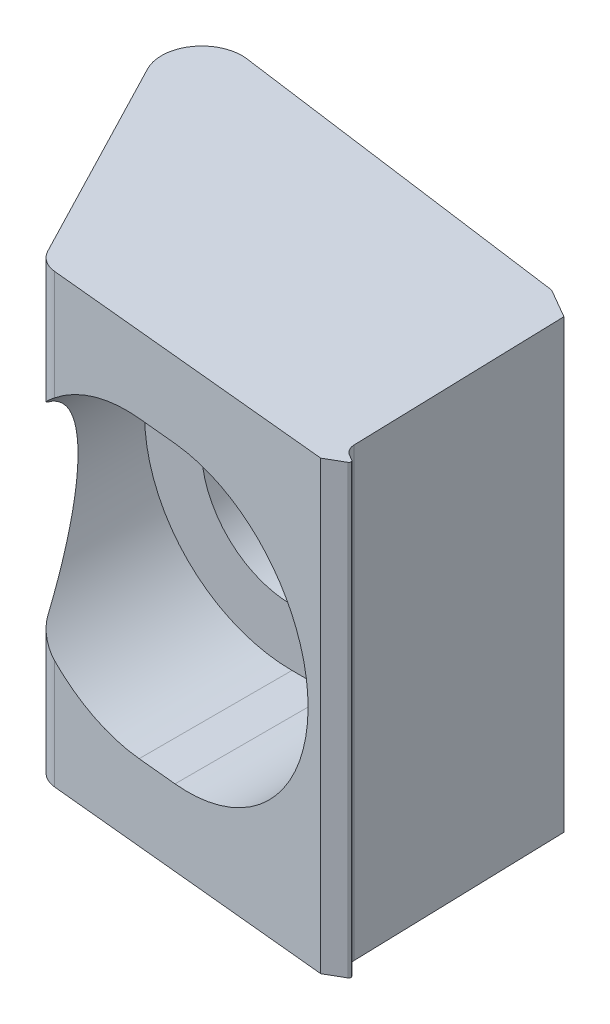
ISO-10303-21;
HEADER;
FILE_DESCRIPTION(('STEP AP214'),'2;1');
FILE_NAME('part.step','',(''),(''),'','','');
FILE_SCHEMA(('AUTOMOTIVE_DESIGN { 1 0 10303 214 1 1 1 1 }'));
ENDSEC;
DATA;
#1=APPLICATION_CONTEXT('core data for automotive mechanical design processes');
#2=APPLICATION_PROTOCOL_DEFINITION('international standard','automotive_design',2000,#1);
#3=PRODUCT_CONTEXT('',#1,'mechanical');
#4=PRODUCT('Part','Part','',(#3));
#5=PRODUCT_RELATED_PRODUCT_CATEGORY('part','',(#4));
#6=PRODUCT_DEFINITION_FORMATION('','',#4);
#7=PRODUCT_DEFINITION_CONTEXT('part definition',#1,'design');
#8=PRODUCT_DEFINITION('design','',#6,#7);
#9=PRODUCT_DEFINITION_SHAPE('','',#8);
#10=(LENGTH_UNIT() NAMED_UNIT(*) SI_UNIT(.MILLI.,.METRE.));
#11=(NAMED_UNIT(*) PLANE_ANGLE_UNIT() SI_UNIT($,.RADIAN.));
#12=(NAMED_UNIT(*) SI_UNIT($,.STERADIAN.) SOLID_ANGLE_UNIT());
#13=UNCERTAINTY_MEASURE_WITH_UNIT(LENGTH_MEASURE(1.E-05),#10,'distance_accuracy_value','');
#14=(GEOMETRIC_REPRESENTATION_CONTEXT(3) GLOBAL_UNCERTAINTY_ASSIGNED_CONTEXT((#13)) GLOBAL_UNIT_ASSIGNED_CONTEXT((#10,
#11,#12)) REPRESENTATION_CONTEXT('',''));
#15=CARTESIAN_POINT('',(0.,0.,0.));
#16=DIRECTION('',(0.,0.,1.));
#17=DIRECTION('',(1.,0.,0.));
#18=AXIS2_PLACEMENT_3D('',#15,#16,#17);
#19=CARTESIAN_POINT('',(-7.43454612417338,12.7,14.44498));
#20=DIRECTION('',(0.,-1.,0.));
#21=DIRECTION('',(1.,0.,0.));
#22=AXIS2_PLACEMENT_3D('',#19,#20,#21);
#23=CYLINDRICAL_SURFACE('',#22,1.524);
#24=DIRECTION('',(0.,-1.,0.));
#25=VECTOR('',#24,1.);
#26=CARTESIAN_POINT('',(-8.78703398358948,12.7,15.1473706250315));
#27=LINE('',#26,#25);
#28=CARTESIAN_POINT('',(-8.78703398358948,12.7,15.1473706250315));
#29=VERTEX_POINT('',#28);
#30=CARTESIAN_POINT('',(-8.78703398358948,5.25961818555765,15.1473706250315));
#31=VERTEX_POINT('',#30);
#32=EDGE_CURVE('E307',#29,#31,#27,.T.);
#33=ORIENTED_EDGE('',*,*,#32,.T.);
#34=CARTESIAN_POINT('',(-8.78703398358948,5.25961818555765,15.1473706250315));
#35=CARTESIAN_POINT('',(-8.76079085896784,5.29219779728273,15.197829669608));
#36=CARTESIAN_POINT('',(-8.73240940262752,5.32690217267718,15.2456475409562));
#37=CARTESIAN_POINT('',(-8.67202665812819,5.39941708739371,15.3361563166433));
#38=CARTESIAN_POINT('',(-8.64003507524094,5.43721922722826,15.378860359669));
#39=CARTESIAN_POINT('',(-8.57303319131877,5.51486622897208,15.4594529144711));
#40=CARTESIAN_POINT('',(-8.53803105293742,5.55470545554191,15.4973537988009));
#41=CARTESIAN_POINT('',(-8.46526377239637,5.63587115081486,15.568722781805));
#42=CARTESIAN_POINT('',(-8.42749637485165,5.67719881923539,15.602187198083));
#43=CARTESIAN_POINT('',(-8.34401173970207,5.76665149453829,15.6691939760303));
#44=CARTESIAN_POINT('',(-8.29792270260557,5.81491640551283,15.7020880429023));
#45=CARTESIAN_POINT('',(-8.20284394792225,5.91204734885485,15.7623510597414));
#46=CARTESIAN_POINT('',(-8.15385233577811,5.9609137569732,15.7897163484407));
#47=CARTESIAN_POINT('',(-8.00293341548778,6.10762483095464,15.8634430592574));
#48=CARTESIAN_POINT('',(-7.89693807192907,6.20571552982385,15.9015337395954));
#49=CARTESIAN_POINT('',(-7.75345208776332,6.33154954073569,15.9356379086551));
#50=CARTESIAN_POINT('',(-7.71955399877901,6.36079990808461,15.9424956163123));
#51=CARTESIAN_POINT('',(-7.65115725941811,6.41886368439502,15.953904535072));
#52=CARTESIAN_POINT('',(-7.61666038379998,6.44767802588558,15.958461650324));
#53=CARTESIAN_POINT('',(-7.58184451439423,6.47628603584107,15.9618449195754));
#54=B_SPLINE_CURVE_WITH_KNOTS('',3,(#34,#35,#36,#37,#38,#39,#40,#41,#42,#43,#44,#45,#46,#47,#48,
#49,#50,#51,#52,#53),.UNSPECIFIED.,.F.,.F.,(4,2,2,2,2,2,2,2,2,4),(0.,0.196340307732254,
0.392164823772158,0.587474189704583,0.782944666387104,1.00585043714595,1.22890334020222,
1.67439355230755,1.8102402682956,1.94573655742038),.UNSPECIFIED.);
#55=CARTESIAN_POINT('',(-7.58184451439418,6.47628603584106,15.9618449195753));
#56=VERTEX_POINT('',#55);
#57=EDGE_CURVE('E210',#31,#56,#54,.T.);
#58=ORIENTED_EDGE('',*,*,#57,.T.);
#59=DIRECTION('',(0.,-1.,0.));
#60=VECTOR('',#59,1.);
#61=CARTESIAN_POINT('',(-7.58184451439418,12.7,15.9618449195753));
#62=LINE('',#61,#60);
#63=CARTESIAN_POINT('',(-7.58184451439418,12.7,15.9618449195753));
#64=VERTEX_POINT('',#63);
#65=EDGE_CURVE('E303',#64,#56,#62,.T.);
#66=ORIENTED_EDGE('',*,*,#65,.F.);
#67=CARTESIAN_POINT('',(-7.43454612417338,12.7,14.44498));
#68=DIRECTION('',(0.,1.,0.));
#69=DIRECTION('',(-1.,0.,0.));
#70=AXIS2_PLACEMENT_3D('',#67,#68,#69);
#71=CIRCLE('',#70,1.524);
#72=EDGE_CURVE('E295',#29,#64,#71,.T.);
#73=ORIENTED_EDGE('',*,*,#72,.F.);
#74=EDGE_LOOP('',(#33,#58,#66,#73));
#75=FACE_BOUND('',#74,.T.);
#76=ADVANCED_FACE('F14',(#75),#23,.T.);
#77=CARTESIAN_POINT('',(9.17959387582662,12.7,17.5895));
#78=DIRECTION('',(-0.499733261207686,0.,-0.866179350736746));
#79=DIRECTION('',(-0.866179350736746,0.,0.499733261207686));
#80=AXIS2_PLACEMENT_3D('',#77,#78,#79);
#81=PLANE('',#80);
#82=DIRECTION('',(0.866179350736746,0.,-0.499733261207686));
#83=VECTOR('',#82,1.);
#84=CARTESIAN_POINT('',(9.17959387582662,-12.7,17.5895));
#85=LINE('',#84,#83);
#86=CARTESIAN_POINT('',(9.17959387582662,-12.7,17.5895));
#87=VERTEX_POINT('',#86);
#88=CARTESIAN_POINT('',(10.16,-12.7,17.0238647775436));
#89=VERTEX_POINT('',#88);
#90=EDGE_CURVE('E251',#87,#89,#85,.T.);
#91=ORIENTED_EDGE('',*,*,#90,.T.);
#92=DIRECTION('',(0.,-1.,0.));
#93=VECTOR('',#92,1.);
#94=CARTESIAN_POINT('',(10.16,12.7,17.0238647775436));
#95=LINE('',#94,#93);
#96=CARTESIAN_POINT('',(10.16,12.7,17.0238647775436));
#97=VERTEX_POINT('',#96);
#98=EDGE_CURVE('E331',#97,#89,#95,.T.);
#99=ORIENTED_EDGE('',*,*,#98,.F.);
#100=DIRECTION('',(0.866179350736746,0.,-0.499733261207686));
#101=VECTOR('',#100,1.);
#102=CARTESIAN_POINT('',(9.17959387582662,12.7,17.5895));
#103=LINE('',#102,#101);
#104=CARTESIAN_POINT('',(9.17959387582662,12.7,17.5895));
#105=VERTEX_POINT('',#104);
#106=EDGE_CURVE('E276',#105,#97,#103,.T.);
#107=ORIENTED_EDGE('',*,*,#106,.F.);
#108=DIRECTION('',(0.,-1.,0.));
#109=VECTOR('',#108,1.);
#110=CARTESIAN_POINT('',(9.17959387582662,12.7,17.5895));
#111=LINE('',#110,#109);
#112=EDGE_CURVE('E299',#105,#87,#111,.T.);
#113=ORIENTED_EDGE('',*,*,#112,.T.);
#114=EDGE_LOOP('',(#91,#99,#107,#113));
#115=FACE_BOUND('',#114,.T.);
#116=ADVANCED_FACE('F16',(#115),#81,.F.);
#117=CARTESIAN_POINT('',(10.0965338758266,12.7,16.91386));
#118=DIRECTION('',(0.,-1.,0.));
#119=DIRECTION('',(1.,0.,0.));
#120=AXIS2_PLACEMENT_3D('',#117,#118,#119);
#121=CYLINDRICAL_SURFACE('',#120,0.127);
#122=CARTESIAN_POINT('',(10.0965338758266,-12.7,16.91386));
#123=DIRECTION('',(0.,1.,0.));
#124=DIRECTION('',(-1.,0.,0.));
#125=AXIS2_PLACEMENT_3D('',#122,#123,#124);
#126=CIRCLE('',#125,0.127);
#127=CARTESIAN_POINT('',(10.160562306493,-12.7,16.8041815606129));
#128=VERTEX_POINT('',#127);
#129=EDGE_CURVE('E254',#89,#128,#126,.T.);
#130=ORIENTED_EDGE('',*,*,#129,.T.);
#131=DIRECTION('',(0.,-1.,0.));
#132=VECTOR('',#131,1.);
#133=CARTESIAN_POINT('',(10.160562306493,12.7,16.8041815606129));
#134=LINE('',#133,#132);
#135=CARTESIAN_POINT('',(10.160562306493,12.7,16.8041815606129));
#136=VERTEX_POINT('',#135);
#137=EDGE_CURVE('E328',#136,#128,#134,.T.);
#138=ORIENTED_EDGE('',*,*,#137,.F.);
#139=CARTESIAN_POINT('',(10.0965338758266,12.7,16.91386));
#140=DIRECTION('',(0.,1.,0.));
#141=DIRECTION('',(-1.,0.,0.));
#142=AXIS2_PLACEMENT_3D('',#139,#140,#141);
#143=CIRCLE('',#142,0.127);
#144=EDGE_CURVE('E279',#97,#136,#143,.T.);
#145=ORIENTED_EDGE('',*,*,#144,.F.);
#146=ORIENTED_EDGE('',*,*,#98,.T.);
#147=EDGE_LOOP('',(#130,#138,#145,#146));
#148=FACE_BOUND('',#147,.T.);
#149=ADVANCED_FACE('F381',(#148),#121,.T.);
#150=CARTESIAN_POINT('',(10.160562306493,12.7,16.8041815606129));
#151=DIRECTION('',(-0.504160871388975,0.,0.86360975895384));
#152=DIRECTION('',(0.86360975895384,0.,0.504160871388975));
#153=AXIS2_PLACEMENT_3D('',#150,#151,#152);
#154=PLANE('',#153);
#155=DIRECTION('',(-0.86360975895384,0.,-0.504160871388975));
#156=VECTOR('',#155,1.);
#157=CARTESIAN_POINT('',(10.160562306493,-12.7,16.8041815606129));
#158=LINE('',#157,#156);
#159=CARTESIAN_POINT('',(9.85714329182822,-12.7,16.6270506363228));
#160=VERTEX_POINT('',#159);
#161=EDGE_CURVE('E256',#128,#160,#158,.T.);
#162=ORIENTED_EDGE('',*,*,#161,.T.);
#163=DIRECTION('',(0.,-1.,0.));
#164=VECTOR('',#163,1.);
#165=CARTESIAN_POINT('',(9.85714329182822,12.7,16.6270506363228));
#166=LINE('',#165,#164);
#167=CARTESIAN_POINT('',(9.85714329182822,12.7,16.6270506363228));
#168=VERTEX_POINT('',#167);
#169=EDGE_CURVE('E325',#168,#160,#166,.T.);
#170=ORIENTED_EDGE('',*,*,#169,.F.);
#171=DIRECTION('',(-0.86360975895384,0.,-0.504160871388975));
#172=VECTOR('',#171,1.);
#173=CARTESIAN_POINT('',(10.160562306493,12.7,16.8041815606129));
#174=LINE('',#173,#172);
#175=EDGE_CURVE('E281',#136,#168,#174,.T.);
#176=ORIENTED_EDGE('',*,*,#175,.F.);
#177=ORIENTED_EDGE('',*,*,#137,.T.);
#178=EDGE_LOOP('',(#162,#170,#176,#177));
#179=FACE_BOUND('',#178,.T.);
#180=ADVANCED_FACE('F413',(#179),#154,.F.);
#181=CARTESIAN_POINT('',(10.2413138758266,12.7,15.96898));
#182=DIRECTION('',(0.,-1.,0.));
#183=DIRECTION('',(1.,0.,0.));
#184=AXIS2_PLACEMENT_3D('',#181,#182,#183);
#185=CYLINDRICAL_SURFACE('',#184,0.762);
#186=CARTESIAN_POINT('',(10.2413138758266,-12.7,15.96898));
#187=DIRECTION('',(0.,-1.,0.));
#188=DIRECTION('',(-1.,0.,0.));
#189=AXIS2_PLACEMENT_3D('',#186,#187,#188);
#190=CIRCLE('',#189,0.762);
#191=CARTESIAN_POINT('',(9.47962441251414,-12.7,15.9907322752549));
#192=VERTEX_POINT('',#191);
#193=EDGE_CURVE('E258',#160,#192,#190,.T.);
#194=ORIENTED_EDGE('',*,*,#193,.T.);
#195=DIRECTION('',(0.,-1.,0.));
#196=VECTOR('',#195,1.);
#197=CARTESIAN_POINT('',(9.47962441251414,12.7,15.9907322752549));
#198=LINE('',#197,#196);
#199=CARTESIAN_POINT('',(9.47962441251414,12.7,15.9907322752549));
#200=VERTEX_POINT('',#199);
#201=EDGE_CURVE('E322',#200,#192,#198,.T.);
#202=ORIENTED_EDGE('',*,*,#201,.F.);
#203=CARTESIAN_POINT('',(10.2413138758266,12.7,15.96898));
#204=DIRECTION('',(0.,-1.,0.));
#205=DIRECTION('',(-1.,0.,0.));
#206=AXIS2_PLACEMENT_3D('',#203,#204,#205);
#207=CIRCLE('',#206,0.762);
#208=EDGE_CURVE('E283',#168,#200,#207,.T.);
#209=ORIENTED_EDGE('',*,*,#208,.F.);
#210=ORIENTED_EDGE('',*,*,#169,.T.);
#211=EDGE_LOOP('',(#194,#202,#209,#210));
#212=FACE_BOUND('',#211,.T.);
#213=ADVANCED_FACE('F409',(#212),#185,.F.);
#214=CARTESIAN_POINT('',(9.47962441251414,12.7,15.9907322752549));
#215=DIRECTION('',(-0.99959247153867,0.,0.0285462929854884));
#216=DIRECTION('',(0.0285462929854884,0.,0.99959247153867));
#217=AXIS2_PLACEMENT_3D('',#214,#215,#216);
#218=PLANE('',#217);
#219=DIRECTION('',(-0.0285462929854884,0.,-0.99959247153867));
#220=VECTOR('',#219,1.);
#221=CARTESIAN_POINT('',(9.47962441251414,-12.7,15.9907322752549));
#222=LINE('',#221,#220);
#223=CARTESIAN_POINT('',(9.12879387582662,-12.7,3.70586));
#224=VERTEX_POINT('',#223);
#225=EDGE_CURVE('E260',#192,#224,#222,.T.);
#226=ORIENTED_EDGE('',*,*,#225,.T.);
#227=DIRECTION('',(0.,-1.,0.));
#228=VECTOR('',#227,1.);
#229=CARTESIAN_POINT('',(9.12879387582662,12.7,3.70586));
#230=LINE('',#229,#228);
#231=CARTESIAN_POINT('',(9.12879387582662,12.7,3.70586));
#232=VERTEX_POINT('',#231);
#233=EDGE_CURVE('E319',#232,#224,#230,.T.);
#234=ORIENTED_EDGE('',*,*,#233,.F.);
#235=DIRECTION('',(-0.0285462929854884,0.,-0.99959247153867));
#236=VECTOR('',#235,1.);
#237=CARTESIAN_POINT('',(9.47962441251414,12.7,15.9907322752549));
#238=LINE('',#237,#236);
#239=EDGE_CURVE('E285',#200,#232,#238,.T.);
#240=ORIENTED_EDGE('',*,*,#239,.F.);
#241=ORIENTED_EDGE('',*,*,#201,.T.);
#242=EDGE_LOOP('',(#226,#234,#240,#241));
#243=FACE_BOUND('',#242,.T.);
#244=ADVANCED_FACE('F405',(#243),#218,.F.);
#245=CARTESIAN_POINT('',(9.12879387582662,12.7,3.70586));
#246=DIRECTION('',(-0.500827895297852,0.,0.865546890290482));
#247=DIRECTION('',(0.865546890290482,0.,0.500827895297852));
#248=AXIS2_PLACEMENT_3D('',#245,#246,#247);
#249=PLANE('',#248);
#250=DIRECTION('',(-0.865546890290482,0.,-0.500827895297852));
#251=VECTOR('',#250,1.);
#252=CARTESIAN_POINT('',(9.12879387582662,-12.7,3.70586));
#253=LINE('',#252,#251);
#254=CARTESIAN_POINT('',(7.46509387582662,-12.7,2.7432));
#255=VERTEX_POINT('',#254);
#256=EDGE_CURVE('E262',#224,#255,#253,.T.);
#257=ORIENTED_EDGE('',*,*,#256,.T.);
#258=DIRECTION('',(0.,-1.,0.));
#259=VECTOR('',#258,1.);
#260=CARTESIAN_POINT('',(7.46509387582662,12.7,2.7432));
#261=LINE('',#260,#259);
#262=CARTESIAN_POINT('',(7.46509387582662,12.7,2.7432));
#263=VERTEX_POINT('',#262);
#264=EDGE_CURVE('E316',#263,#255,#261,.T.);
#265=ORIENTED_EDGE('',*,*,#264,.F.);
#266=DIRECTION('',(-0.865546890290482,0.,-0.500827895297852));
#267=VECTOR('',#266,1.);
#268=CARTESIAN_POINT('',(9.12879387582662,12.7,3.70586));
#269=LINE('',#268,#267);
#270=EDGE_CURVE('E287',#232,#263,#269,.T.);
#271=ORIENTED_EDGE('',*,*,#270,.F.);
#272=ORIENTED_EDGE('',*,*,#233,.T.);
#273=EDGE_LOOP('',(#257,#265,#271,#272));
#274=FACE_BOUND('',#273,.T.);
#275=ADVANCED_FACE('F401',(#274),#249,.F.);
#276=CARTESIAN_POINT('',(-12.5828622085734,12.7,0.0207901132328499));
#277=DIRECTION('',(-0.134559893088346,0.,0.990905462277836));
#278=DIRECTION('',(0.990905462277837,0.,0.134559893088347));
#279=AXIS2_PLACEMENT_3D('',#276,#277,#278);
#280=PLANE('',#279);
#281=DIRECTION('',(-0.990905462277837,0.,-0.134559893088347));
#282=VECTOR('',#281,1.);
#283=CARTESIAN_POINT('',(-12.5828622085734,5.1562,0.0207901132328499));
#284=LINE('',#283,#282);
#285=CARTESIAN_POINT('',(0.,5.1562,1.7294784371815));
#286=VERTEX_POINT('',#285);
#287=CARTESIAN_POINT('',(-2.2606,5.1562,1.42250052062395));
#288=VERTEX_POINT('',#287);
#289=EDGE_CURVE('E188',#286,#288,#284,.T.);
#290=ORIENTED_EDGE('',*,*,#289,.T.);
#291=CARTESIAN_POINT('',(-2.2606,0.,1.42250052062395));
#292=DIRECTION('',(-0.134559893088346,0.,0.990905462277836));
#293=DIRECTION('',(0.990905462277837,0.,0.134559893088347));
#294=AXIS2_PLACEMENT_3D('',#291,#292,#293);
#295=ELLIPSE('',#294,5.2035236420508,5.1562);
#296=CARTESIAN_POINT('',(-2.2606,-5.1562,1.42250052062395));
#297=VERTEX_POINT('',#296);
#298=EDGE_CURVE('E191',#288,#297,#295,.T.);
#299=ORIENTED_EDGE('',*,*,#298,.T.);
#300=DIRECTION('',(0.990905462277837,0.,0.134559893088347));
#301=VECTOR('',#300,1.);
#302=CARTESIAN_POINT('',(-12.5828622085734,-5.1562,0.0207901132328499));
#303=LINE('',#302,#301);
#304=CARTESIAN_POINT('',(0.,-5.1562,1.7294784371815));
#305=VERTEX_POINT('',#304);
#306=EDGE_CURVE('E183',#297,#305,#303,.T.);
#307=ORIENTED_EDGE('',*,*,#306,.T.);
#308=CARTESIAN_POINT('',(0.,0.,1.7294784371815));
#309=DIRECTION('',(-0.134559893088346,0.,0.990905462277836));
#310=DIRECTION('',(0.990905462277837,0.,0.134559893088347));
#311=AXIS2_PLACEMENT_3D('',#308,#309,#310);
#312=ELLIPSE('',#311,5.2035236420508,5.1562);
#313=EDGE_CURVE('E163',#305,#286,#312,.T.);
#314=ORIENTED_EDGE('',*,*,#313,.T.);
#315=EDGE_LOOP('',(#290,#299,#307,#314));
#316=FACE_BOUND('',#315,.T.);
#317=DIRECTION('',(-0.990905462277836,0.,-0.134559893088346));
#318=VECTOR('',#317,1.);
#319=CARTESIAN_POINT('',(-12.5828622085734,-12.7,0.0207901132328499));
#320=LINE('',#319,#318);
#321=CARTESIAN_POINT('',(-12.5828622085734,-12.7,0.0207901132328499));
#322=VERTEX_POINT('',#321);
#323=EDGE_CURVE('E264',#255,#322,#320,.T.);
#324=ORIENTED_EDGE('',*,*,#323,.T.);
#325=DIRECTION('',(0.,-1.,0.));
#326=VECTOR('',#325,1.);
#327=CARTESIAN_POINT('',(-12.5828622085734,12.7,0.0207901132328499));
#328=LINE('',#327,#326);
#329=CARTESIAN_POINT('',(-12.5828622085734,12.7,0.0207901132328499));
#330=VERTEX_POINT('',#329);
#331=EDGE_CURVE('E313',#330,#322,#328,.T.);
#332=ORIENTED_EDGE('',*,*,#331,.F.);
#333=DIRECTION('',(-0.990905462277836,0.,-0.134559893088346));
#334=VECTOR('',#333,1.);
#335=CARTESIAN_POINT('',(-12.5828622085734,12.7,0.0207901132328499));
#336=LINE('',#335,#334);
#337=EDGE_CURVE('E289',#263,#330,#336,.T.);
#338=ORIENTED_EDGE('',*,*,#337,.F.);
#339=ORIENTED_EDGE('',*,*,#264,.T.);
#340=EDGE_LOOP('',(#324,#332,#338,#339));
#341=FACE_BOUND('',#340,.T.);
#342=ADVANCED_FACE('F395',(#316,#341),#280,.F.);
#343=CARTESIAN_POINT('',(-12.8904661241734,12.7,2.286));
#344=DIRECTION('',(0.,-1.,0.));
#345=DIRECTION('',(1.,0.,0.));
#346=AXIS2_PLACEMENT_3D('',#343,#344,#345);
#347=CYLINDRICAL_SURFACE('',#346,2.286);
#348=CARTESIAN_POINT('',(-12.8904661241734,-12.7,2.286));
#349=DIRECTION('',(0.,1.,0.));
#350=DIRECTION('',(-1.,0.,0.));
#351=AXIS2_PLACEMENT_3D('',#348,#349,#350);
#352=CIRCLE('',#351,2.286);
#353=CARTESIAN_POINT('',(-14.9191979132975,-12.7,3.33958593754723));
#354=VERTEX_POINT('',#353);
#355=EDGE_CURVE('E266',#322,#354,#352,.T.);
#356=ORIENTED_EDGE('',*,*,#355,.T.);
#357=DIRECTION('',(0.,-1.,0.));
#358=VECTOR('',#357,1.);
#359=CARTESIAN_POINT('',(-14.9191979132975,12.7,3.33958593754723));
#360=LINE('',#359,#358);
#361=CARTESIAN_POINT('',(-14.9191979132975,12.7,3.33958593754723));
#362=VERTEX_POINT('',#361);
#363=EDGE_CURVE('E310',#362,#354,#360,.T.);
#364=ORIENTED_EDGE('',*,*,#363,.F.);
#365=CARTESIAN_POINT('',(-12.8904661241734,12.7,2.286));
#366=DIRECTION('',(0.,1.,0.));
#367=DIRECTION('',(-1.,0.,0.));
#368=AXIS2_PLACEMENT_3D('',#365,#366,#367);
#369=CIRCLE('',#368,2.286);
#370=EDGE_CURVE('E291',#330,#362,#369,.T.);
#371=ORIENTED_EDGE('',*,*,#370,.F.);
#372=ORIENTED_EDGE('',*,*,#331,.T.);
#373=EDGE_LOOP('',(#356,#364,#371,#372));
#374=FACE_BOUND('',#373,.T.);
#375=ADVANCED_FACE('F390',(#374),#347,.T.);
#376=CARTESIAN_POINT('',(-8.78703398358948,12.7,15.1473706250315));
#377=DIRECTION('',(0.887459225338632,0.,-0.460886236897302));
#378=DIRECTION('',(-0.460886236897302,0.,-0.887459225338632));
#379=AXIS2_PLACEMENT_3D('',#376,#377,#378);
#380=PLANE('',#379);
#381=CARTESIAN_POINT('',(-8.78703398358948,-5.25961818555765,15.1473706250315));
#382=VERTEX_POINT('',#381);
#383=CARTESIAN_POINT('',(-8.78703398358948,-12.7,15.1473706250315));
#384=VERTEX_POINT('',#383);
#385=EDGE_CURVE('E306',#382,#384,#27,.T.);
#386=ORIENTED_EDGE('',*,*,#385,.F.);
#387=CARTESIAN_POINT('',(-2.2606,0.,27.7143417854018));
#388=DIRECTION('',(0.887459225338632,0.,-0.460886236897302));
#389=DIRECTION('',(0.460886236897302,0.,0.887459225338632));
#390=AXIS2_PLACEMENT_3D('',#387,#388,#389);
#391=ELLIPSE('',#390,18.1867005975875,8.382);
#392=EDGE_CURVE('E226',#382,#31,#391,.T.);
#393=ORIENTED_EDGE('',*,*,#392,.T.);
#394=ORIENTED_EDGE('',*,*,#32,.F.);
#395=DIRECTION('',(0.460886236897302,0.,0.887459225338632));
#396=VECTOR('',#395,1.);
#397=CARTESIAN_POINT('',(-8.78703398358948,12.7,15.1473706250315));
#398=LINE('',#397,#396);
#399=EDGE_CURVE('E293',#362,#29,#398,.T.);
#400=ORIENTED_EDGE('',*,*,#399,.F.);
#401=ORIENTED_EDGE('',*,*,#363,.T.);
#402=DIRECTION('',(0.460886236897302,0.,0.887459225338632));
#403=VECTOR('',#402,1.);
#404=CARTESIAN_POINT('',(-8.78703398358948,-12.7,15.1473706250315));
#405=LINE('',#404,#403);
#406=EDGE_CURVE('E268',#354,#384,#405,.T.);
#407=ORIENTED_EDGE('',*,*,#406,.T.);
#408=EDGE_LOOP('',(#386,#393,#394,#400,#401,#407));
#409=FACE_BOUND('',#408,.T.);
#410=ADVANCED_FACE('F354',(#409),#380,.F.);
#411=CARTESIAN_POINT('',(-7.58184451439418,-6.47628603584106,15.9618449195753));
#412=VERTEX_POINT('',#411);
#413=CARTESIAN_POINT('',(-7.58184451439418,-12.7,15.9618449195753));
#414=VERTEX_POINT('',#413);
#415=EDGE_CURVE('E302',#412,#414,#62,.T.);
#416=ORIENTED_EDGE('',*,*,#415,.F.);
#417=CARTESIAN_POINT('',(-7.58184451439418,-6.47628603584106,15.9618449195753));
#418=CARTESIAN_POINT('',(-7.63123848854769,-6.43570386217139,15.9570397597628));
#419=CARTESIAN_POINT('',(-7.67999484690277,-6.3946931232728,15.9498790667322));
#420=CARTESIAN_POINT('',(-7.7760481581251,-6.31203361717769,15.9310327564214));
#421=CARTESIAN_POINT('',(-7.82334553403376,-6.27038504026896,15.91934846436));
#422=CARTESIAN_POINT('',(-7.96387242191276,-6.14382345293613,15.8774680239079));
#423=CARTESIAN_POINT('',(-8.05460644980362,-6.05822580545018,15.8405607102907));
#424=CARTESIAN_POINT('',(-8.19059369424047,-5.9243521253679,15.7693969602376));
#425=CARTESIAN_POINT('',(-8.23866500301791,-5.87581234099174,15.7407907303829));
#426=CARTESIAN_POINT('',(-8.33185922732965,-5.77946464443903,15.6780886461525));
#427=CARTESIAN_POINT('',(-8.37698359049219,-5.73165638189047,15.6439955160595));
#428=CARTESIAN_POINT('',(-8.46370239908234,-5.63768665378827,15.570426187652));
#429=CARTESIAN_POINT('',(-8.50531641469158,-5.59151702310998,15.5309835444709));
#430=CARTESIAN_POINT('',(-8.58485665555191,-5.50139116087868,15.4463441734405));
#431=CARTESIAN_POINT('',(-8.62278681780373,-5.4574325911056,15.4011537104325));
#432=CARTESIAN_POINT('',(-8.68196644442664,-5.38751228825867,15.3213706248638));
#433=CARTESIAN_POINT('',(-8.70444305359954,-5.36059077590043,15.2885287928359));
#434=CARTESIAN_POINT('',(-8.74735003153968,-5.30859187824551,15.2200603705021));
#435=CARTESIAN_POINT('',(-8.76777699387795,-5.28351758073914,15.1844293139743));
#436=CARTESIAN_POINT('',(-8.78703398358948,-5.25961818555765,15.1473706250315));
#437=B_SPLINE_CURVE_WITH_KNOTS('',3,(#417,#418,#419,#420,#421,#422,#423,#424,#425,#426,#427,
#428,#429,#430,#431,#432,#433,#434,#435,#436),.UNSPECIFIED.,.F.,.F.,(4,2,2,2,2,2,2,2,2,4),(0.,
0.19219465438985,0.384333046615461,0.772976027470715,0.994958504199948,1.21683110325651,
1.43737134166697,1.65767322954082,1.80166951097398,1.94590127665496),.UNSPECIFIED.);
#438=EDGE_CURVE('E244',#412,#382,#437,.T.);
#439=ORIENTED_EDGE('',*,*,#438,.T.);
#440=ORIENTED_EDGE('',*,*,#385,.T.);
#441=CARTESIAN_POINT('',(-7.43454612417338,-12.7,14.44498));
#442=DIRECTION('',(0.,1.,0.));
#443=DIRECTION('',(-1.,0.,0.));
#444=AXIS2_PLACEMENT_3D('',#441,#442,#443);
#445=CIRCLE('',#444,1.524);
#446=EDGE_CURVE('E271',#384,#414,#445,.T.);
#447=ORIENTED_EDGE('',*,*,#446,.T.);
#448=EDGE_LOOP('',(#416,#439,#440,#447));
#449=FACE_BOUND('',#448,.T.);
#450=ADVANCED_FACE('F228',(#449),#23,.T.);
#451=CARTESIAN_POINT('',(-7.58184451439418,12.7,15.9618449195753));
#452=DIRECTION('',(0.0966524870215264,0.,-0.995318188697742));
#453=DIRECTION('',(-0.995318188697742,0.,-0.0966524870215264));
#454=AXIS2_PLACEMENT_3D('',#451,#452,#453);
#455=PLANE('',#454);
#456=DIRECTION('',(-0.995318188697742,0.,-0.0966524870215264));
#457=VECTOR('',#456,1.);
#458=CARTESIAN_POINT('',(-7.58184451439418,-8.382,15.9618449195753));
#459=LINE('',#458,#457);
#460=CARTESIAN_POINT('',(0.,-8.382,16.6980960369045));
#461=VERTEX_POINT('',#460);
#462=CARTESIAN_POINT('',(-2.2606,-8.382,16.4785756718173));
#463=VERTEX_POINT('',#462);
#464=EDGE_CURVE('E334',#461,#463,#459,.T.);
#465=ORIENTED_EDGE('',*,*,#464,.T.);
#466=CARTESIAN_POINT('',(-2.2606,0.,16.4785756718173));
#467=DIRECTION('',(0.0966524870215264,0.,-0.995318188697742));
#468=DIRECTION('',(0.995318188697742,0.,0.0966524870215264));
#469=AXIS2_PLACEMENT_3D('',#466,#467,#468);
#470=ELLIPSE('',#469,8.4214275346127,8.382);
#471=EDGE_CURVE('E9',#463,#412,#470,.T.);
#472=ORIENTED_EDGE('',*,*,#471,.T.);
#473=ORIENTED_EDGE('',*,*,#415,.T.);
#474=DIRECTION('',(0.995318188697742,0.,0.0966524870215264));
#475=VECTOR('',#474,1.);
#476=CARTESIAN_POINT('',(-7.58184451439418,-12.7,15.9618449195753));
#477=LINE('',#476,#475);
#478=EDGE_CURVE('E274',#414,#87,#477,.T.);
#479=ORIENTED_EDGE('',*,*,#478,.T.);
#480=ORIENTED_EDGE('',*,*,#112,.F.);
#481=DIRECTION('',(0.995318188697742,0.,0.0966524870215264));
#482=VECTOR('',#481,1.);
#483=CARTESIAN_POINT('',(-7.58184451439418,12.7,15.9618449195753));
#484=LINE('',#483,#482);
#485=EDGE_CURVE('E297',#64,#105,#484,.T.);
#486=ORIENTED_EDGE('',*,*,#485,.F.);
#487=ORIENTED_EDGE('',*,*,#65,.T.);
#488=CARTESIAN_POINT('',(-2.2606,8.382,16.4785756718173));
#489=VERTEX_POINT('',#488);
#490=EDGE_CURVE('E18',#56,#489,#470,.T.);
#491=ORIENTED_EDGE('',*,*,#490,.T.);
#492=DIRECTION('',(0.995318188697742,0.,0.0966524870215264));
#493=VECTOR('',#492,1.);
#494=CARTESIAN_POINT('',(-7.58184451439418,8.382,15.9618449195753));
#495=LINE('',#494,#493);
#496=CARTESIAN_POINT('',(0.,8.382,16.6980960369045));
#497=VERTEX_POINT('',#496);
#498=EDGE_CURVE('E339',#489,#497,#495,.T.);
#499=ORIENTED_EDGE('',*,*,#498,.T.);
#500=CARTESIAN_POINT('',(0.,0.,16.6980960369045));
#501=DIRECTION('',(0.0966524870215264,0.,-0.995318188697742));
#502=DIRECTION('',(0.995318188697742,0.,0.0966524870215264));
#503=AXIS2_PLACEMENT_3D('',#500,#501,#502);
#504=ELLIPSE('',#503,8.4214275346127,8.382);
#505=EDGE_CURVE('E337',#497,#461,#504,.T.);
#506=ORIENTED_EDGE('',*,*,#505,.T.);
#507=EDGE_LOOP('',(#465,#472,#473,#479,#480,#486,#487,#491,#499,#506));
#508=FACE_BOUND('',#507,.T.);
#509=ADVANCED_FACE('F343',(#508),#455,.F.);
#510=CARTESIAN_POINT('',(10.0965338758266,12.7,16.91386));
#511=DIRECTION('',(0.,1.,0.));
#512=DIRECTION('',(-1.,0.,0.));
#513=AXIS2_PLACEMENT_3D('',#510,#511,#512);
#514=PLANE('',#513);
#515=ORIENTED_EDGE('',*,*,#106,.T.);
#516=ORIENTED_EDGE('',*,*,#144,.T.);
#517=ORIENTED_EDGE('',*,*,#175,.T.);
#518=ORIENTED_EDGE('',*,*,#208,.T.);
#519=ORIENTED_EDGE('',*,*,#239,.T.);
#520=ORIENTED_EDGE('',*,*,#270,.T.);
#521=ORIENTED_EDGE('',*,*,#337,.T.);
#522=ORIENTED_EDGE('',*,*,#370,.T.);
#523=ORIENTED_EDGE('',*,*,#399,.T.);
#524=ORIENTED_EDGE('',*,*,#72,.T.);
#525=ORIENTED_EDGE('',*,*,#485,.T.);
#526=EDGE_LOOP('',(#515,#516,#517,#518,#519,#520,#521,#522,#523,#524,#525));
#527=FACE_BOUND('',#526,.T.);
#528=ADVANCED_FACE('F389',(#527),#514,.T.);
#529=CARTESIAN_POINT('',(10.0965338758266,-12.7,16.91386));
#530=DIRECTION('',(0.,1.,0.));
#531=DIRECTION('',(-1.,0.,0.));
#532=AXIS2_PLACEMENT_3D('',#529,#530,#531);
#533=PLANE('',#532);
#534=ORIENTED_EDGE('',*,*,#90,.F.);
#535=ORIENTED_EDGE('',*,*,#478,.F.);
#536=ORIENTED_EDGE('',*,*,#446,.F.);
#537=ORIENTED_EDGE('',*,*,#406,.F.);
#538=ORIENTED_EDGE('',*,*,#355,.F.);
#539=ORIENTED_EDGE('',*,*,#323,.F.);
#540=ORIENTED_EDGE('',*,*,#256,.F.);
#541=ORIENTED_EDGE('',*,*,#225,.F.);
#542=ORIENTED_EDGE('',*,*,#193,.F.);
#543=ORIENTED_EDGE('',*,*,#161,.F.);
#544=ORIENTED_EDGE('',*,*,#129,.F.);
#545=EDGE_LOOP('',(#534,#535,#536,#537,#538,#539,#540,#541,#542,#543,#544));
#546=FACE_BOUND('',#545,.T.);
#547=ADVANCED_FACE('F238',(#546),#533,.F.);
#548=CARTESIAN_POINT('',(-2.2606,0.,7.7851));
#549=DIRECTION('',(0.,0.,1.));
#550=DIRECTION('',(0.,1.,0.));
#551=AXIS2_PLACEMENT_3D('',#548,#549,#550);
#552=CYLINDRICAL_SURFACE('',#551,8.382);
#553=DIRECTION('',(0.,0.,1.));
#554=VECTOR('',#553,1.);
#555=CARTESIAN_POINT('',(-2.2606,-8.382,7.7851));
#556=LINE('',#555,#554);
#557=CARTESIAN_POINT('',(-2.2606,-8.382,7.7851));
#558=VERTEX_POINT('',#557);
#559=EDGE_CURVE('E206',#558,#463,#556,.T.);
#560=ORIENTED_EDGE('',*,*,#559,.F.);
#561=CARTESIAN_POINT('',(-2.2606,0.,7.7851));
#562=DIRECTION('',(0.,0.,1.));
#563=DIRECTION('',(0.,1.,0.));
#564=AXIS2_PLACEMENT_3D('',#561,#562,#563);
#565=CIRCLE('',#564,8.382);
#566=CARTESIAN_POINT('',(-2.2606,8.382,7.7851));
#567=VERTEX_POINT('',#566);
#568=EDGE_CURVE('E194',#567,#558,#565,.T.);
#569=ORIENTED_EDGE('',*,*,#568,.F.);
#570=DIRECTION('',(0.,0.,1.));
#571=VECTOR('',#570,1.);
#572=CARTESIAN_POINT('',(-2.2606,8.382,7.7851));
#573=LINE('',#572,#571);
#574=EDGE_CURVE('E207',#567,#489,#573,.T.);
#575=ORIENTED_EDGE('',*,*,#574,.T.);
#576=ORIENTED_EDGE('',*,*,#490,.F.);
#577=ORIENTED_EDGE('',*,*,#57,.F.);
#578=ORIENTED_EDGE('',*,*,#392,.F.);
#579=ORIENTED_EDGE('',*,*,#438,.F.);
#580=ORIENTED_EDGE('',*,*,#471,.F.);
#581=EDGE_LOOP('',(#560,#569,#575,#576,#577,#578,#579,#580));
#582=FACE_BOUND('',#581,.T.);
#583=ADVANCED_FACE('F232',(#582),#552,.F.);
#584=CARTESIAN_POINT('',(-2.2606,8.382,7.7851));
#585=DIRECTION('',(0.,1.,0.));
#586=DIRECTION('',(-1.,0.,0.));
#587=AXIS2_PLACEMENT_3D('',#584,#585,#586);
#588=PLANE('',#587);
#589=ORIENTED_EDGE('',*,*,#574,.F.);
#590=DIRECTION('',(-1.,0.,0.));
#591=VECTOR('',#590,1.);
#592=CARTESIAN_POINT('',(-2.2606,8.382,7.7851));
#593=LINE('',#592,#591);
#594=CARTESIAN_POINT('',(0.,8.382,7.7851));
#595=VERTEX_POINT('',#594);
#596=EDGE_CURVE('E203',#595,#567,#593,.T.);
#597=ORIENTED_EDGE('',*,*,#596,.F.);
#598=DIRECTION('',(0.,0.,1.));
#599=VECTOR('',#598,1.);
#600=CARTESIAN_POINT('',(0.,8.382,7.7851));
#601=LINE('',#600,#599);
#602=EDGE_CURVE('E211',#595,#497,#601,.T.);
#603=ORIENTED_EDGE('',*,*,#602,.T.);
#604=ORIENTED_EDGE('',*,*,#498,.F.);
#605=EDGE_LOOP('',(#589,#597,#603,#604));
#606=FACE_BOUND('',#605,.T.);
#607=ADVANCED_FACE('F237',(#606),#588,.F.);
#608=CARTESIAN_POINT('',(0.,0.,7.7851));
#609=DIRECTION('',(0.,0.,1.));
#610=DIRECTION('',(0.,1.,0.));
#611=AXIS2_PLACEMENT_3D('',#608,#609,#610);
#612=CYLINDRICAL_SURFACE('',#611,8.382);
#613=ORIENTED_EDGE('',*,*,#602,.F.);
#614=CARTESIAN_POINT('',(0.,0.,7.7851));
#615=DIRECTION('',(0.,0.,1.));
#616=DIRECTION('',(0.,1.,0.));
#617=AXIS2_PLACEMENT_3D('',#614,#615,#616);
#618=CIRCLE('',#617,8.382);
#619=CARTESIAN_POINT('',(0.,-8.382,7.7851));
#620=VERTEX_POINT('',#619);
#621=EDGE_CURVE('E200',#620,#595,#618,.T.);
#622=ORIENTED_EDGE('',*,*,#621,.F.);
#623=DIRECTION('',(0.,0.,1.));
#624=VECTOR('',#623,1.);
#625=CARTESIAN_POINT('',(0.,-8.382,7.7851));
#626=LINE('',#625,#624);
#627=EDGE_CURVE('E214',#620,#461,#626,.T.);
#628=ORIENTED_EDGE('',*,*,#627,.T.);
#629=ORIENTED_EDGE('',*,*,#505,.F.);
#630=EDGE_LOOP('',(#613,#622,#628,#629));
#631=FACE_BOUND('',#630,.T.);
#632=ADVANCED_FACE('F367',(#631),#612,.F.);
#633=CARTESIAN_POINT('',(0.,-8.382,7.7851));
#634=DIRECTION('',(0.,-1.,0.));
#635=DIRECTION('',(1.,0.,0.));
#636=AXIS2_PLACEMENT_3D('',#633,#634,#635);
#637=PLANE('',#636);
#638=ORIENTED_EDGE('',*,*,#627,.F.);
#639=DIRECTION('',(1.,0.,0.));
#640=VECTOR('',#639,1.);
#641=CARTESIAN_POINT('',(0.,-8.382,7.7851));
#642=LINE('',#641,#640);
#643=EDGE_CURVE('E197',#558,#620,#642,.T.);
#644=ORIENTED_EDGE('',*,*,#643,.F.);
#645=ORIENTED_EDGE('',*,*,#559,.T.);
#646=ORIENTED_EDGE('',*,*,#464,.F.);
#647=EDGE_LOOP('',(#638,#644,#645,#646));
#648=FACE_BOUND('',#647,.T.);
#649=ADVANCED_FACE('F240',(#648),#637,.F.);
#650=CARTESIAN_POINT('',(-2.2606,0.,7.7851));
#651=DIRECTION('',(0.,0.,1.));
#652=DIRECTION('',(0.,1.,0.));
#653=AXIS2_PLACEMENT_3D('',#650,#651,#652);
#654=PLANE('',#653);
#655=CARTESIAN_POINT('',(-2.2606,0.,7.7851));
#656=DIRECTION('',(0.,0.,1.));
#657=DIRECTION('',(0.,1.,0.));
#658=AXIS2_PLACEMENT_3D('',#655,#656,#657);
#659=CIRCLE('',#658,5.1562);
#660=CARTESIAN_POINT('',(-2.2606,5.1562,7.7851));
#661=VERTEX_POINT('',#660);
#662=CARTESIAN_POINT('',(-2.2606,-5.1562,7.7851));
#663=VERTEX_POINT('',#662);
#664=EDGE_CURVE('E37',#661,#663,#659,.T.);
#665=ORIENTED_EDGE('',*,*,#664,.F.);
#666=DIRECTION('',(-1.,0.,0.));
#667=VECTOR('',#666,1.);
#668=CARTESIAN_POINT('',(-2.2606,5.1562,7.7851));
#669=LINE('',#668,#667);
#670=CARTESIAN_POINT('',(0.,5.1562,7.7851));
#671=VERTEX_POINT('',#670);
#672=EDGE_CURVE('E176',#671,#661,#669,.T.);
#673=ORIENTED_EDGE('',*,*,#672,.F.);
#674=CARTESIAN_POINT('',(0.,0.,7.7851));
#675=DIRECTION('',(0.,0.,1.));
#676=DIRECTION('',(0.,1.,0.));
#677=AXIS2_PLACEMENT_3D('',#674,#675,#676);
#678=CIRCLE('',#677,5.1562);
#679=CARTESIAN_POINT('',(0.,-5.1562,7.7851));
#680=VERTEX_POINT('',#679);
#681=EDGE_CURVE('E160',#680,#671,#678,.T.);
#682=ORIENTED_EDGE('',*,*,#681,.F.);
#683=DIRECTION('',(1.,0.,0.));
#684=VECTOR('',#683,1.);
#685=CARTESIAN_POINT('',(-2.2606,-5.1562,7.7851));
#686=LINE('',#685,#684);
#687=EDGE_CURVE('E169',#663,#680,#686,.T.);
#688=ORIENTED_EDGE('',*,*,#687,.F.);
#689=EDGE_LOOP('',(#665,#673,#682,#688));
#690=FACE_BOUND('',#689,.T.);
#691=ORIENTED_EDGE('',*,*,#568,.T.);
#692=ORIENTED_EDGE('',*,*,#643,.T.);
#693=ORIENTED_EDGE('',*,*,#621,.T.);
#694=ORIENTED_EDGE('',*,*,#596,.T.);
#695=EDGE_LOOP('',(#691,#692,#693,#694));
#696=FACE_BOUND('',#695,.T.);
#697=ADVANCED_FACE('F173',(#690,#696),#654,.T.);
#698=CARTESIAN_POINT('',(-2.2606,0.,0.));
#699=DIRECTION('',(0.,0.,1.));
#700=DIRECTION('',(0.,1.,0.));
#701=AXIS2_PLACEMENT_3D('',#698,#699,#700);
#702=CYLINDRICAL_SURFACE('',#701,5.1562);
#703=DIRECTION('',(0.,0.,1.));
#704=VECTOR('',#703,1.);
#705=CARTESIAN_POINT('',(-2.2606,5.1562,0.));
#706=LINE('',#705,#704);
#707=EDGE_CURVE('E181',#288,#661,#706,.T.);
#708=ORIENTED_EDGE('',*,*,#707,.T.);
#709=ORIENTED_EDGE('',*,*,#664,.T.);
#710=DIRECTION('',(0.,0.,1.));
#711=VECTOR('',#710,1.);
#712=CARTESIAN_POINT('',(-2.2606,-5.1562,0.));
#713=LINE('',#712,#711);
#714=EDGE_CURVE('E166',#297,#663,#713,.T.);
#715=ORIENTED_EDGE('',*,*,#714,.F.);
#716=ORIENTED_EDGE('',*,*,#298,.F.);
#717=EDGE_LOOP('',(#708,#709,#715,#716));
#718=FACE_BOUND('',#717,.T.);
#719=ADVANCED_FACE('F556',(#718),#702,.F.);
#720=CARTESIAN_POINT('',(-2.2606,5.1562,0.));
#721=DIRECTION('',(0.,1.,0.));
#722=DIRECTION('',(-1.,0.,0.));
#723=AXIS2_PLACEMENT_3D('',#720,#721,#722);
#724=PLANE('',#723);
#725=DIRECTION('',(0.,0.,1.));
#726=VECTOR('',#725,1.);
#727=CARTESIAN_POINT('',(0.,5.1562,0.));
#728=LINE('',#727,#726);
#729=EDGE_CURVE('E165',#286,#671,#728,.T.);
#730=ORIENTED_EDGE('',*,*,#729,.T.);
#731=ORIENTED_EDGE('',*,*,#672,.T.);
#732=ORIENTED_EDGE('',*,*,#707,.F.);
#733=ORIENTED_EDGE('',*,*,#289,.F.);
#734=EDGE_LOOP('',(#730,#731,#732,#733));
#735=FACE_BOUND('',#734,.T.);
#736=ADVANCED_FACE('F563',(#735),#724,.F.);
#737=CARTESIAN_POINT('',(0.,0.,0.));
#738=DIRECTION('',(0.,0.,1.));
#739=DIRECTION('',(0.,1.,0.));
#740=AXIS2_PLACEMENT_3D('',#737,#738,#739);
#741=CYLINDRICAL_SURFACE('',#740,5.1562);
#742=DIRECTION('',(0.,0.,1.));
#743=VECTOR('',#742,1.);
#744=CARTESIAN_POINT('',(0.,-5.1562,0.));
#745=LINE('',#744,#743);
#746=EDGE_CURVE('E29',#305,#680,#745,.T.);
#747=ORIENTED_EDGE('',*,*,#746,.T.);
#748=ORIENTED_EDGE('',*,*,#681,.T.);
#749=ORIENTED_EDGE('',*,*,#729,.F.);
#750=ORIENTED_EDGE('',*,*,#313,.F.);
#751=EDGE_LOOP('',(#747,#748,#749,#750));
#752=FACE_BOUND('',#751,.T.);
#753=ADVANCED_FACE('F157',(#752),#741,.F.);
#754=CARTESIAN_POINT('',(-2.2606,-5.1562,0.));
#755=DIRECTION('',(0.,-1.,0.));
#756=DIRECTION('',(1.,0.,0.));
#757=AXIS2_PLACEMENT_3D('',#754,#755,#756);
#758=PLANE('',#757);
#759=ORIENTED_EDGE('',*,*,#714,.T.);
#760=ORIENTED_EDGE('',*,*,#687,.T.);
#761=ORIENTED_EDGE('',*,*,#746,.F.);
#762=ORIENTED_EDGE('',*,*,#306,.F.);
#763=EDGE_LOOP('',(#759,#760,#761,#762));
#764=FACE_BOUND('',#763,.T.);
#765=ADVANCED_FACE('F170',(#764),#758,.F.);
#766=CLOSED_SHELL('',(#76,#116,#149,#180,#213,#244,#275,#342,#375,#410,#450,#509,#528,#547,#583,
#607,#632,#649,#697,#719,#736,#753,#765));
#767=MANIFOLD_SOLID_BREP('B1',#766);
#768=ADVANCED_BREP_SHAPE_REPRESENTATION('',(#18,#767),#14);
#769=SHAPE_DEFINITION_REPRESENTATION(#9,#768);
ENDSEC;
END-ISO-10303-21;
